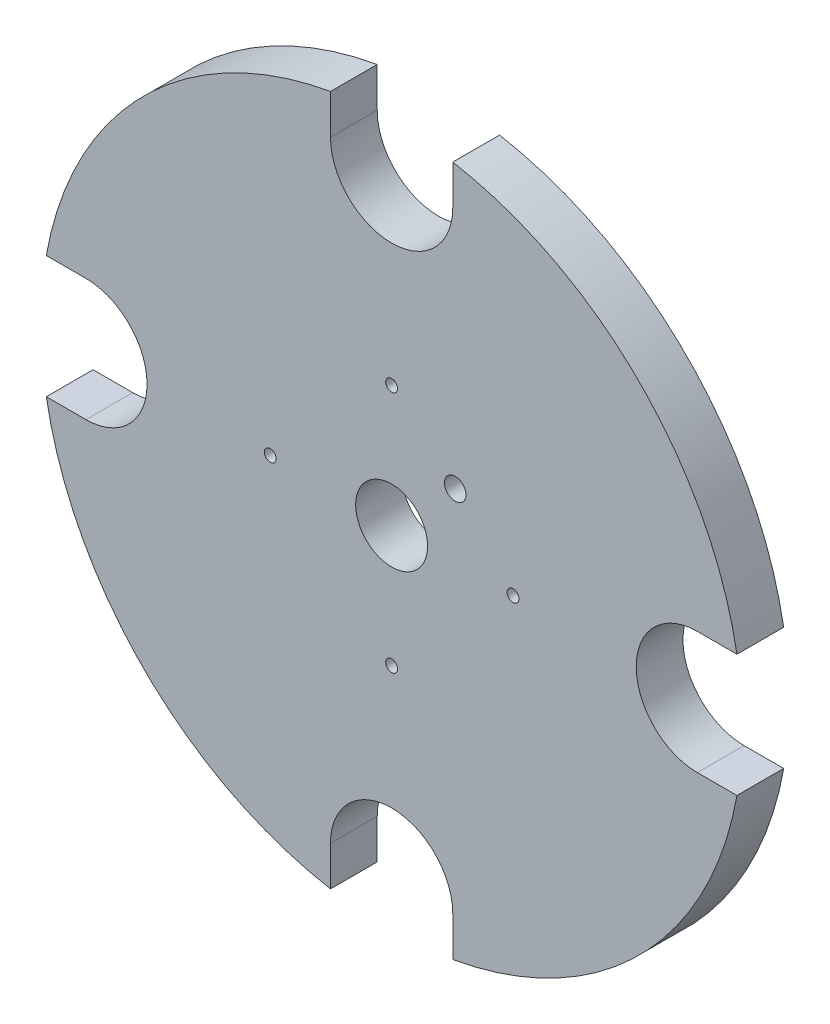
from build123d import *

# Parameters (mm, degrees)
ESQUISSE1_R             = 195
ESQUISSE1_R_2           = 20
BASE_EXTRUSION_DEPTH    = 26
ENL_V_MAT_EXTRU_1_DEPTH = 277.994584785
PER_AGE1_D              = 6.6
ESQUISSE5_R             = 6
ENL_V_MAT_EXTRU_2_DEPTH = 273.789295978
ESQUISSE6_R             = 18
ENL_V_MAT_EXTRU_3_DEPTH = 14


with BuildPart() as part:
    # Esquisse1 → Base-Extrusion (new body)
    with BuildSketch(Plane.XY):
        Circle(ESQUISSE1_R)
        with Locations(Location((0, 0, 0), (0, 0, 180))):
            Circle(ESQUISSE1_R_2, mode=Mode.SUBTRACT)
    extrude(amount=BASE_EXTRUSION_DEPTH)

    # Esquisse2 → Enl_v. mat.-Extru.1 (cut, through all)
    with BuildSketch(Plane.XY.offset(26)):
        with BuildLine():
            Line((170, 34), (192.013020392, 34))
            ThreePointArc((192.013020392, 34), (195, 0), (192.013020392, -34))
            Line((192.013020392, -34), (170, -34))
            ThreePointArc((170, -34), (136, 0), (170, 34))
        make_face()
        with BuildLine():
            Line((34, -170), (34, -192.013020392))
            ThreePointArc((34, -192.013020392), (0, -195), (-34, -192.013020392))
            Line((-34, -192.013020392), (-34, -170))
            ThreePointArc((-34, -170), (0, -136), (34, -170))
        make_face()
        with BuildLine():
            Line((-170, -34), (-192.013020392, -34))
            ThreePointArc((-192.013020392, -34), (-195, 0), (-192.013020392, 34))
            Line((-192.013020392, 34), (-170, 34))
            ThreePointArc((-170, 34), (-136, 0), (-170, -34))
        make_face()
        with BuildLine():
            Line((-34, 170), (-34, 192.013020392))
            ThreePointArc((-34, 192.013020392), (0, 195), (34, 192.013020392))
            Line((34, 192.013020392), (34, 170))
            ThreePointArc((34, 170), (0, 136), (-34, 170))
        make_face()
    extrude(amount=-ENL_V_MAT_EXTRU_1_DEPTH, mode=Mode.SUBTRACT)

    # Per_age1 (through all)
    with Locations(Plane.XY.offset(26)):
        with Locations((0, 67.5), (67.5, 0), (0, -67.5), (-67.5, 0)):
            Hole(PER_AGE1_D / 2)

    # Esquisse5 → Enl_v. mat.-Extru.2 (cut, through all)
    with BuildSketch(Plane.XY.offset(26)):
        with Locations((35.355339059, 35.355339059)):
            Circle(ESQUISSE5_R)
    extrude(amount=-ENL_V_MAT_EXTRU_2_DEPTH, mode=Mode.SUBTRACT)

    # Esquisse6 → Enl_v. mat.-Extru.3 (cut)
    with BuildSketch(Plane(origin=(0, 0, 0), x_dir=(-1, 0, 0), z_dir=(0, 0, -1))):
        with Locations((-35.355339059, 35.355339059)):
            Circle(ESQUISSE6_R)
    extrude(amount=-ENL_V_MAT_EXTRU_3_DEPTH, mode=Mode.SUBTRACT)


solid = part.part
